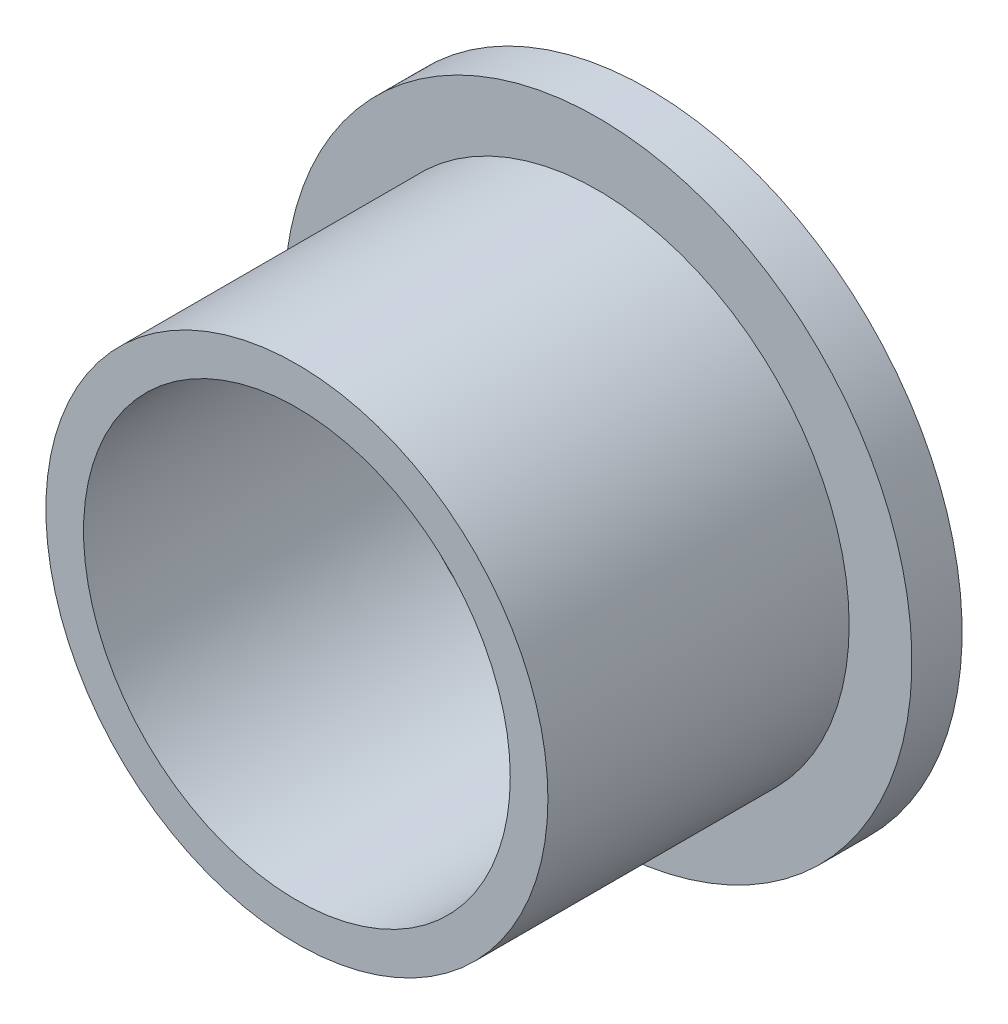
ISO-10303-21;
HEADER;
FILE_DESCRIPTION(('STEP AP214'),'2;1');
FILE_NAME('part.step','',(''),(''),'','','');
FILE_SCHEMA(('AUTOMOTIVE_DESIGN { 1 0 10303 214 1 1 1 1 }'));
ENDSEC;
DATA;
#1=APPLICATION_CONTEXT('core data for automotive mechanical design processes');
#2=APPLICATION_PROTOCOL_DEFINITION('international standard','automotive_design',2000,#1);
#3=PRODUCT_CONTEXT('',#1,'mechanical');
#4=PRODUCT('Part','Part','',(#3));
#5=PRODUCT_RELATED_PRODUCT_CATEGORY('part','',(#4));
#6=PRODUCT_DEFINITION_FORMATION('','',#4);
#7=PRODUCT_DEFINITION_CONTEXT('part definition',#1,'design');
#8=PRODUCT_DEFINITION('design','',#6,#7);
#9=PRODUCT_DEFINITION_SHAPE('','',#8);
#10=(LENGTH_UNIT() NAMED_UNIT(*) SI_UNIT(.MILLI.,.METRE.));
#11=(NAMED_UNIT(*) PLANE_ANGLE_UNIT() SI_UNIT($,.RADIAN.));
#12=(NAMED_UNIT(*) SI_UNIT($,.STERADIAN.) SOLID_ANGLE_UNIT());
#13=UNCERTAINTY_MEASURE_WITH_UNIT(LENGTH_MEASURE(1.E-05),#10,'distance_accuracy_value','');
#14=(GEOMETRIC_REPRESENTATION_CONTEXT(3) GLOBAL_UNCERTAINTY_ASSIGNED_CONTEXT((#13)) GLOBAL_UNIT_ASSIGNED_CONTEXT((#10,
#11,#12)) REPRESENTATION_CONTEXT('',''));
#15=CARTESIAN_POINT('',(0.,0.,0.));
#16=DIRECTION('',(0.,0.,1.));
#17=DIRECTION('',(1.,0.,0.));
#18=AXIS2_PLACEMENT_3D('',#15,#16,#17);
#19=CARTESIAN_POINT('',(0.,0.,12.));
#20=DIRECTION('',(0.,0.,1.));
#21=DIRECTION('',(1.,0.,0.));
#22=AXIS2_PLACEMENT_3D('',#19,#20,#21);
#23=PLANE('',#22);
#24=CARTESIAN_POINT('',(0.,0.,12.));
#25=DIRECTION('',(0.,0.,1.));
#26=DIRECTION('',(1.,0.,0.));
#27=AXIS2_PLACEMENT_3D('',#24,#25,#26);
#28=CIRCLE('',#27,10.);
#29=CARTESIAN_POINT('',(10.,0.,12.));
#30=VERTEX_POINT('',#29);
#31=EDGE_CURVE('E10',#30,#30,#28,.T.);
#32=ORIENTED_EDGE('',*,*,#31,.T.);
#33=EDGE_LOOP('',(#32));
#34=FACE_BOUND('',#33,.T.);
#35=CARTESIAN_POINT('',(0.,0.,12.));
#36=DIRECTION('',(0.,0.,1.));
#37=DIRECTION('',(1.,0.,0.));
#38=AXIS2_PLACEMENT_3D('',#35,#36,#37);
#39=CIRCLE('',#38,8.5);
#40=CARTESIAN_POINT('',(8.5,0.,12.));
#41=VERTEX_POINT('',#40);
#42=EDGE_CURVE('E50',#41,#41,#39,.T.);
#43=ORIENTED_EDGE('',*,*,#42,.F.);
#44=EDGE_LOOP('',(#43));
#45=FACE_BOUND('',#44,.T.);
#46=ADVANCED_FACE('F39',(#34,#45),#23,.T.);
#47=CARTESIAN_POINT('',(0.,0.,12.));
#48=DIRECTION('',(0.,0.,-1.));
#49=DIRECTION('',(-1.,0.,0.));
#50=AXIS2_PLACEMENT_3D('',#47,#48,#49);
#51=CYLINDRICAL_SURFACE('',#50,10.);
#52=ORIENTED_EDGE('',*,*,#31,.F.);
#53=EDGE_LOOP('',(#52));
#54=FACE_BOUND('',#53,.T.);
#55=CARTESIAN_POINT('',(0.,0.,0.));
#56=DIRECTION('',(0.,0.,1.));
#57=DIRECTION('',(1.,0.,0.));
#58=AXIS2_PLACEMENT_3D('',#55,#56,#57);
#59=CIRCLE('',#58,10.);
#60=CARTESIAN_POINT('',(10.,0.,0.));
#61=VERTEX_POINT('',#60);
#62=EDGE_CURVE('E43',#61,#61,#59,.T.);
#63=ORIENTED_EDGE('',*,*,#62,.T.);
#64=EDGE_LOOP('',(#63));
#65=FACE_BOUND('',#64,.T.);
#66=ADVANCED_FACE('F41',(#54,#65),#51,.T.);
#67=CARTESIAN_POINT('',(0.,0.,12.));
#68=DIRECTION('',(0.,0.,-1.));
#69=DIRECTION('',(-1.,0.,0.));
#70=AXIS2_PLACEMENT_3D('',#67,#68,#69);
#71=CYLINDRICAL_SURFACE('',#70,8.5);
#72=ORIENTED_EDGE('',*,*,#42,.T.);
#73=EDGE_LOOP('',(#72));
#74=FACE_BOUND('',#73,.T.);
#75=CARTESIAN_POINT('',(0.,0.,0.));
#76=DIRECTION('',(0.,0.,1.));
#77=DIRECTION('',(1.,0.,0.));
#78=AXIS2_PLACEMENT_3D('',#75,#76,#77);
#79=CIRCLE('',#78,8.5);
#80=CARTESIAN_POINT('',(8.5,0.,0.));
#81=VERTEX_POINT('',#80);
#82=EDGE_CURVE('E51',#81,#81,#79,.T.);
#83=ORIENTED_EDGE('',*,*,#82,.F.);
#84=EDGE_LOOP('',(#83));
#85=FACE_BOUND('',#84,.T.);
#86=ADVANCED_FACE('F85',(#74,#85),#71,.F.);
#87=CARTESIAN_POINT('',(0.,0.,0.));
#88=DIRECTION('',(0.,0.,-1.));
#89=DIRECTION('',(-1.,0.,0.));
#90=AXIS2_PLACEMENT_3D('',#87,#88,#89);
#91=PLANE('',#90);
#92=ORIENTED_EDGE('',*,*,#82,.T.);
#93=EDGE_LOOP('',(#92));
#94=FACE_BOUND('',#93,.T.);
#95=ADVANCED_FACE('F75',(#94),#91,.F.);
#96=CARTESIAN_POINT('',(0.,0.,-2.));
#97=DIRECTION('',(0.,0.,1.));
#98=DIRECTION('',(1.,0.,0.));
#99=AXIS2_PLACEMENT_3D('',#96,#97,#98);
#100=CYLINDRICAL_SURFACE('',#99,12.5);
#101=CARTESIAN_POINT('',(0.,0.,-2.));
#102=DIRECTION('',(0.,0.,-1.));
#103=DIRECTION('',(-1.,0.,0.));
#104=AXIS2_PLACEMENT_3D('',#101,#102,#103);
#105=CIRCLE('',#104,12.5);
#106=CARTESIAN_POINT('',(-12.5,0.,-2.));
#107=VERTEX_POINT('',#106);
#108=EDGE_CURVE('E56',#107,#107,#105,.T.);
#109=ORIENTED_EDGE('',*,*,#108,.F.);
#110=EDGE_LOOP('',(#109));
#111=FACE_BOUND('',#110,.T.);
#112=CARTESIAN_POINT('',(0.,0.,0.));
#113=DIRECTION('',(0.,0.,-1.));
#114=DIRECTION('',(-1.,0.,0.));
#115=AXIS2_PLACEMENT_3D('',#112,#113,#114);
#116=CIRCLE('',#115,12.5);
#117=CARTESIAN_POINT('',(-12.5,0.,0.));
#118=VERTEX_POINT('',#117);
#119=EDGE_CURVE('E57',#118,#118,#116,.T.);
#120=ORIENTED_EDGE('',*,*,#119,.T.);
#121=EDGE_LOOP('',(#120));
#122=FACE_BOUND('',#121,.T.);
#123=ADVANCED_FACE('F73',(#111,#122),#100,.T.);
#124=CARTESIAN_POINT('',(0.,0.,-2.));
#125=DIRECTION('',(0.,0.,-1.));
#126=DIRECTION('',(-1.,0.,0.));
#127=AXIS2_PLACEMENT_3D('',#124,#125,#126);
#128=PLANE('',#127);
#129=ORIENTED_EDGE('',*,*,#108,.T.);
#130=EDGE_LOOP('',(#129));
#131=FACE_BOUND('',#130,.T.);
#132=ADVANCED_FACE('F66',(#131),#128,.T.);
#133=ORIENTED_EDGE('',*,*,#62,.F.);
#134=EDGE_LOOP('',(#133));
#135=FACE_BOUND('',#134,.T.);
#136=ORIENTED_EDGE('',*,*,#119,.F.);
#137=EDGE_LOOP('',(#136));
#138=FACE_BOUND('',#137,.T.);
#139=ADVANCED_FACE('F69',(#135,#138),#91,.F.);
#140=CLOSED_SHELL('',(#46,#66,#86,#95,#123,#132,#139));
#141=MANIFOLD_SOLID_BREP('B2',#140);
#142=ADVANCED_BREP_SHAPE_REPRESENTATION('',(#18,#141),#14);
#143=SHAPE_DEFINITION_REPRESENTATION(#9,#142);
ENDSEC;
END-ISO-10303-21;
